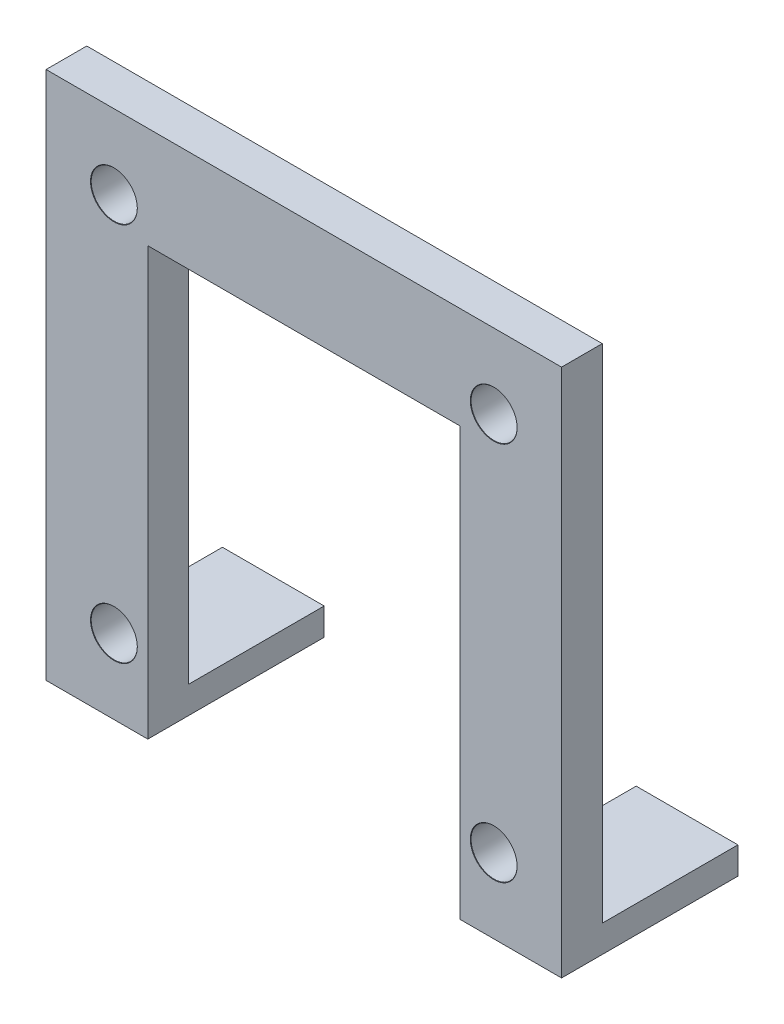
ISO-10303-21;
HEADER;
FILE_DESCRIPTION(('STEP AP214'),'2;1');
FILE_NAME('part.step','',(''),(''),'','','');
FILE_SCHEMA(('AUTOMOTIVE_DESIGN { 1 0 10303 214 1 1 1 1 }'));
ENDSEC;
DATA;
#1=APPLICATION_CONTEXT('core data for automotive mechanical design processes');
#2=APPLICATION_PROTOCOL_DEFINITION('international standard','automotive_design',2000,#1);
#3=PRODUCT_CONTEXT('',#1,'mechanical');
#4=PRODUCT('Part','Part','',(#3));
#5=PRODUCT_RELATED_PRODUCT_CATEGORY('part','',(#4));
#6=PRODUCT_DEFINITION_FORMATION('','',#4);
#7=PRODUCT_DEFINITION_CONTEXT('part definition',#1,'design');
#8=PRODUCT_DEFINITION('design','',#6,#7);
#9=PRODUCT_DEFINITION_SHAPE('','',#8);
#10=(LENGTH_UNIT() NAMED_UNIT(*) SI_UNIT(.MILLI.,.METRE.));
#11=(NAMED_UNIT(*) PLANE_ANGLE_UNIT() SI_UNIT($,.RADIAN.));
#12=(NAMED_UNIT(*) SI_UNIT($,.STERADIAN.) SOLID_ANGLE_UNIT());
#13=UNCERTAINTY_MEASURE_WITH_UNIT(LENGTH_MEASURE(1.E-05),#10,'distance_accuracy_value','');
#14=(GEOMETRIC_REPRESENTATION_CONTEXT(3) GLOBAL_UNCERTAINTY_ASSIGNED_CONTEXT((#13)) GLOBAL_UNIT_ASSIGNED_CONTEXT((#10,
#11,#12)) REPRESENTATION_CONTEXT('',''));
#15=CARTESIAN_POINT('',(0.,0.,0.));
#16=DIRECTION('',(0.,0.,1.));
#17=DIRECTION('',(1.,0.,0.));
#18=AXIS2_PLACEMENT_3D('',#15,#16,#17);
#19=CARTESIAN_POINT('',(7.5,0.,3.));
#20=DIRECTION('',(0.,1.,0.));
#21=DIRECTION('',(-1.,0.,0.));
#22=AXIS2_PLACEMENT_3D('',#19,#20,#21);
#23=PLANE('',#22);
#24=DIRECTION('',(0.,0.,-1.));
#25=VECTOR('',#24,1.);
#26=CARTESIAN_POINT('',(0.,0.,3.));
#27=LINE('',#26,#25);
#28=CARTESIAN_POINT('',(0.,0.,3.));
#29=VERTEX_POINT('',#28);
#30=CARTESIAN_POINT('',(0.,0.,-10.));
#31=VERTEX_POINT('',#30);
#32=EDGE_CURVE('E273',#29,#31,#27,.T.);
#33=ORIENTED_EDGE('',*,*,#32,.T.);
#34=DIRECTION('',(-1.,0.,0.));
#35=VECTOR('',#34,1.);
#36=CARTESIAN_POINT('',(7.5,0.,-10.));
#37=LINE('',#36,#35);
#38=CARTESIAN_POINT('',(7.5,0.,-10.));
#39=VERTEX_POINT('',#38);
#40=EDGE_CURVE('E193',#39,#31,#37,.T.);
#41=ORIENTED_EDGE('',*,*,#40,.F.);
#42=DIRECTION('',(0.,0.,-1.));
#43=VECTOR('',#42,1.);
#44=CARTESIAN_POINT('',(7.5,0.,3.));
#45=LINE('',#44,#43);
#46=CARTESIAN_POINT('',(7.5,0.,3.));
#47=VERTEX_POINT('',#46);
#48=EDGE_CURVE('E11',#47,#39,#45,.T.);
#49=ORIENTED_EDGE('',*,*,#48,.F.);
#50=DIRECTION('',(1.,0.,0.));
#51=VECTOR('',#50,1.);
#52=CARTESIAN_POINT('',(7.5,0.,3.));
#53=LINE('',#52,#51);
#54=EDGE_CURVE('E249',#29,#47,#53,.T.);
#55=ORIENTED_EDGE('',*,*,#54,.F.);
#56=EDGE_LOOP('',(#33,#41,#49,#55));
#57=FACE_BOUND('',#56,.T.);
#58=ADVANCED_FACE('F44',(#57),#23,.F.);
#59=CARTESIAN_POINT('',(7.5,31.5,3.));
#60=DIRECTION('',(-1.,0.,0.));
#61=DIRECTION('',(0.,0.,1.));
#62=AXIS2_PLACEMENT_3D('',#59,#60,#61);
#63=PLANE('',#62);
#64=ORIENTED_EDGE('',*,*,#48,.T.);
#65=DIRECTION('',(0.,-1.,0.));
#66=VECTOR('',#65,1.);
#67=CARTESIAN_POINT('',(7.5,2.00000000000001,-10.));
#68=LINE('',#67,#66);
#69=CARTESIAN_POINT('',(7.5,2.00000000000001,-10.));
#70=VERTEX_POINT('',#69);
#71=EDGE_CURVE('E186',#70,#39,#68,.T.);
#72=ORIENTED_EDGE('',*,*,#71,.F.);
#73=DIRECTION('',(0.,0.,1.));
#74=VECTOR('',#73,1.);
#75=CARTESIAN_POINT('',(7.5,2.00000000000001,-10.));
#76=LINE('',#75,#74);
#77=CARTESIAN_POINT('',(7.5,2.00000000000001,0.));
#78=VERTEX_POINT('',#77);
#79=EDGE_CURVE('E185',#70,#78,#76,.T.);
#80=ORIENTED_EDGE('',*,*,#79,.T.);
#81=DIRECTION('',(0.,1.,0.));
#82=VECTOR('',#81,1.);
#83=CARTESIAN_POINT('',(7.5,31.5,0.));
#84=LINE('',#83,#82);
#85=CARTESIAN_POINT('',(7.5,31.5,0.));
#86=VERTEX_POINT('',#85);
#87=EDGE_CURVE('E248',#78,#86,#84,.T.);
#88=ORIENTED_EDGE('',*,*,#87,.T.);
#89=DIRECTION('',(0.,0.,-1.));
#90=VECTOR('',#89,1.);
#91=CARTESIAN_POINT('',(7.5,31.5,3.));
#92=LINE('',#91,#90);
#93=CARTESIAN_POINT('',(7.5,31.5,3.));
#94=VERTEX_POINT('',#93);
#95=EDGE_CURVE('E52',#94,#86,#92,.T.);
#96=ORIENTED_EDGE('',*,*,#95,.F.);
#97=DIRECTION('',(0.,1.,0.));
#98=VECTOR('',#97,1.);
#99=CARTESIAN_POINT('',(7.5,31.5,3.));
#100=LINE('',#99,#98);
#101=EDGE_CURVE('E251',#47,#94,#100,.T.);
#102=ORIENTED_EDGE('',*,*,#101,.F.);
#103=EDGE_LOOP('',(#64,#72,#80,#88,#96,#102));
#104=FACE_BOUND('',#103,.T.);
#105=ADVANCED_FACE('F329',(#104),#63,.F.);
#106=CARTESIAN_POINT('',(30.5,31.5,3.));
#107=DIRECTION('',(0.,1.,0.));
#108=DIRECTION('',(0.,0.,1.));
#109=AXIS2_PLACEMENT_3D('',#106,#107,#108);
#110=PLANE('',#109);
#111=DIRECTION('',(1.,0.,0.));
#112=VECTOR('',#111,1.);
#113=CARTESIAN_POINT('',(30.5,31.5,0.));
#114=LINE('',#113,#112);
#115=CARTESIAN_POINT('',(30.5,31.5,0.));
#116=VERTEX_POINT('',#115);
#117=EDGE_CURVE('E279',#86,#116,#114,.T.);
#118=ORIENTED_EDGE('',*,*,#117,.T.);
#119=DIRECTION('',(0.,0.,-1.));
#120=VECTOR('',#119,1.);
#121=CARTESIAN_POINT('',(30.5,31.5,3.));
#122=LINE('',#121,#120);
#123=CARTESIAN_POINT('',(30.5,31.5,3.));
#124=VERTEX_POINT('',#123);
#125=EDGE_CURVE('E143',#124,#116,#122,.T.);
#126=ORIENTED_EDGE('',*,*,#125,.F.);
#127=DIRECTION('',(1.,0.,0.));
#128=VECTOR('',#127,1.);
#129=CARTESIAN_POINT('',(30.5,31.5,3.));
#130=LINE('',#129,#128);
#131=EDGE_CURVE('E259',#94,#124,#130,.T.);
#132=ORIENTED_EDGE('',*,*,#131,.F.);
#133=ORIENTED_EDGE('',*,*,#95,.T.);
#134=EDGE_LOOP('',(#118,#126,#132,#133));
#135=FACE_BOUND('',#134,.T.);
#136=ADVANCED_FACE('F315',(#135),#110,.F.);
#137=CARTESIAN_POINT('',(30.5,0.,3.));
#138=DIRECTION('',(1.,0.,0.));
#139=DIRECTION('',(0.,0.,-1.));
#140=AXIS2_PLACEMENT_3D('',#137,#138,#139);
#141=PLANE('',#140);
#142=DIRECTION('',(0.,-1.,0.));
#143=VECTOR('',#142,1.);
#144=CARTESIAN_POINT('',(30.5,0.,0.));
#145=LINE('',#144,#143);
#146=CARTESIAN_POINT('',(30.5,2.,0.));
#147=VERTEX_POINT('',#146);
#148=EDGE_CURVE('E281',#116,#147,#145,.T.);
#149=ORIENTED_EDGE('',*,*,#148,.T.);
#150=DIRECTION('',(0.,0.,1.));
#151=VECTOR('',#150,1.);
#152=CARTESIAN_POINT('',(30.5,2.,-10.));
#153=LINE('',#152,#151);
#154=CARTESIAN_POINT('',(30.5,2.,-10.));
#155=VERTEX_POINT('',#154);
#156=EDGE_CURVE('E155',#155,#147,#153,.T.);
#157=ORIENTED_EDGE('',*,*,#156,.F.);
#158=DIRECTION('',(0.,1.,0.));
#159=VECTOR('',#158,1.);
#160=CARTESIAN_POINT('',(30.5,0.,-10.));
#161=LINE('',#160,#159);
#162=CARTESIAN_POINT('',(30.5,0.,-10.));
#163=VERTEX_POINT('',#162);
#164=EDGE_CURVE('E146',#163,#155,#161,.T.);
#165=ORIENTED_EDGE('',*,*,#164,.F.);
#166=DIRECTION('',(0.,0.,-1.));
#167=VECTOR('',#166,1.);
#168=CARTESIAN_POINT('',(30.5,0.,3.));
#169=LINE('',#168,#167);
#170=CARTESIAN_POINT('',(30.5,0.,3.));
#171=VERTEX_POINT('',#170);
#172=EDGE_CURVE('E134',#171,#163,#169,.T.);
#173=ORIENTED_EDGE('',*,*,#172,.F.);
#174=DIRECTION('',(0.,-1.,0.));
#175=VECTOR('',#174,1.);
#176=CARTESIAN_POINT('',(30.5,0.,3.));
#177=LINE('',#176,#175);
#178=EDGE_CURVE('E261',#124,#171,#177,.T.);
#179=ORIENTED_EDGE('',*,*,#178,.F.);
#180=ORIENTED_EDGE('',*,*,#125,.T.);
#181=EDGE_LOOP('',(#149,#157,#165,#173,#179,#180));
#182=FACE_BOUND('',#181,.T.);
#183=ADVANCED_FACE('F148',(#182),#141,.F.);
#184=CARTESIAN_POINT('',(38.,0.,3.));
#185=DIRECTION('',(0.,1.,0.));
#186=DIRECTION('',(-1.,0.,0.));
#187=AXIS2_PLACEMENT_3D('',#184,#185,#186);
#188=PLANE('',#187);
#189=ORIENTED_EDGE('',*,*,#172,.T.);
#190=DIRECTION('',(-1.,0.,0.));
#191=VECTOR('',#190,1.);
#192=CARTESIAN_POINT('',(38.,0.,-10.));
#193=LINE('',#192,#191);
#194=CARTESIAN_POINT('',(38.,0.,-10.));
#195=VERTEX_POINT('',#194);
#196=EDGE_CURVE('E139',#195,#163,#193,.T.);
#197=ORIENTED_EDGE('',*,*,#196,.F.);
#198=DIRECTION('',(0.,0.,-1.));
#199=VECTOR('',#198,1.);
#200=CARTESIAN_POINT('',(38.,0.,3.));
#201=LINE('',#200,#199);
#202=CARTESIAN_POINT('',(38.,0.,3.));
#203=VERTEX_POINT('',#202);
#204=EDGE_CURVE('E147',#203,#195,#201,.T.);
#205=ORIENTED_EDGE('',*,*,#204,.F.);
#206=DIRECTION('',(1.,0.,0.));
#207=VECTOR('',#206,1.);
#208=CARTESIAN_POINT('',(38.,0.,3.));
#209=LINE('',#208,#207);
#210=EDGE_CURVE('E142',#171,#203,#209,.T.);
#211=ORIENTED_EDGE('',*,*,#210,.F.);
#212=EDGE_LOOP('',(#189,#197,#205,#211));
#213=FACE_BOUND('',#212,.T.);
#214=ADVANCED_FACE('F140',(#213),#188,.F.);
#215=CARTESIAN_POINT('',(38.,39.,3.));
#216=DIRECTION('',(-1.,0.,0.));
#217=DIRECTION('',(0.,-1.,0.));
#218=AXIS2_PLACEMENT_3D('',#215,#216,#217);
#219=PLANE('',#218);
#220=ORIENTED_EDGE('',*,*,#204,.T.);
#221=DIRECTION('',(0.,-1.,0.));
#222=VECTOR('',#221,1.);
#223=CARTESIAN_POINT('',(38.,2.,-10.));
#224=LINE('',#223,#222);
#225=CARTESIAN_POINT('',(38.,2.,-10.));
#226=VERTEX_POINT('',#225);
#227=EDGE_CURVE('E163',#226,#195,#224,.T.);
#228=ORIENTED_EDGE('',*,*,#227,.F.);
#229=DIRECTION('',(0.,0.,1.));
#230=VECTOR('',#229,1.);
#231=CARTESIAN_POINT('',(38.,2.,-10.));
#232=LINE('',#231,#230);
#233=CARTESIAN_POINT('',(38.,2.,0.));
#234=VERTEX_POINT('',#233);
#235=EDGE_CURVE('E167',#226,#234,#232,.T.);
#236=ORIENTED_EDGE('',*,*,#235,.T.);
#237=DIRECTION('',(0.,1.,0.));
#238=VECTOR('',#237,1.);
#239=CARTESIAN_POINT('',(38.,39.,0.));
#240=LINE('',#239,#238);
#241=CARTESIAN_POINT('',(38.,39.,0.));
#242=VERTEX_POINT('',#241);
#243=EDGE_CURVE('E283',#234,#242,#240,.T.);
#244=ORIENTED_EDGE('',*,*,#243,.T.);
#245=DIRECTION('',(0.,0.,-1.));
#246=VECTOR('',#245,1.);
#247=CARTESIAN_POINT('',(38.,39.,3.));
#248=LINE('',#247,#246);
#249=CARTESIAN_POINT('',(38.,39.,3.));
#250=VERTEX_POINT('',#249);
#251=EDGE_CURVE('E296',#250,#242,#248,.T.);
#252=ORIENTED_EDGE('',*,*,#251,.F.);
#253=DIRECTION('',(0.,1.,0.));
#254=VECTOR('',#253,1.);
#255=CARTESIAN_POINT('',(38.,39.,3.));
#256=LINE('',#255,#254);
#257=EDGE_CURVE('E266',#203,#250,#256,.T.);
#258=ORIENTED_EDGE('',*,*,#257,.F.);
#259=EDGE_LOOP('',(#220,#228,#236,#244,#252,#258));
#260=FACE_BOUND('',#259,.T.);
#261=ADVANCED_FACE('F322',(#260),#219,.F.);
#262=CARTESIAN_POINT('',(0.,39.,3.));
#263=DIRECTION('',(0.,-1.,0.));
#264=DIRECTION('',(0.,0.,-1.));
#265=AXIS2_PLACEMENT_3D('',#262,#263,#264);
#266=PLANE('',#265);
#267=DIRECTION('',(-1.,0.,0.));
#268=VECTOR('',#267,1.);
#269=CARTESIAN_POINT('',(0.,39.,0.));
#270=LINE('',#269,#268);
#271=CARTESIAN_POINT('',(0.,39.,0.));
#272=VERTEX_POINT('',#271);
#273=EDGE_CURVE('E290',#242,#272,#270,.T.);
#274=ORIENTED_EDGE('',*,*,#273,.T.);
#275=DIRECTION('',(0.,0.,-1.));
#276=VECTOR('',#275,1.);
#277=CARTESIAN_POINT('',(0.,39.,3.));
#278=LINE('',#277,#276);
#279=CARTESIAN_POINT('',(0.,39.,3.));
#280=VERTEX_POINT('',#279);
#281=EDGE_CURVE('E295',#280,#272,#278,.T.);
#282=ORIENTED_EDGE('',*,*,#281,.F.);
#283=DIRECTION('',(-1.,0.,0.));
#284=VECTOR('',#283,1.);
#285=CARTESIAN_POINT('',(0.,39.,3.));
#286=LINE('',#285,#284);
#287=EDGE_CURVE('E267',#250,#280,#286,.T.);
#288=ORIENTED_EDGE('',*,*,#287,.F.);
#289=ORIENTED_EDGE('',*,*,#251,.T.);
#290=EDGE_LOOP('',(#274,#282,#288,#289));
#291=FACE_BOUND('',#290,.T.);
#292=ADVANCED_FACE('F347',(#291),#266,.F.);
#293=CARTESIAN_POINT('',(0.,0.,3.));
#294=DIRECTION('',(1.,0.,0.));
#295=DIRECTION('',(0.,0.,-1.));
#296=AXIS2_PLACEMENT_3D('',#293,#294,#295);
#297=PLANE('',#296);
#298=DIRECTION('',(0.,-1.,0.));
#299=VECTOR('',#298,1.);
#300=CARTESIAN_POINT('',(0.,0.,0.));
#301=LINE('',#300,#299);
#302=CARTESIAN_POINT('',(0.,2.00000000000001,0.));
#303=VERTEX_POINT('',#302);
#304=EDGE_CURVE('E253',#272,#303,#301,.T.);
#305=ORIENTED_EDGE('',*,*,#304,.T.);
#306=DIRECTION('',(0.,0.,1.));
#307=VECTOR('',#306,1.);
#308=CARTESIAN_POINT('',(0.,2.00000000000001,-10.));
#309=LINE('',#308,#307);
#310=CARTESIAN_POINT('',(0.,2.00000000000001,-10.));
#311=VERTEX_POINT('',#310);
#312=EDGE_CURVE('E178',#311,#303,#309,.T.);
#313=ORIENTED_EDGE('',*,*,#312,.F.);
#314=DIRECTION('',(0.,1.,0.));
#315=VECTOR('',#314,1.);
#316=CARTESIAN_POINT('',(0.,0.,-10.));
#317=LINE('',#316,#315);
#318=EDGE_CURVE('E195',#31,#311,#317,.T.);
#319=ORIENTED_EDGE('',*,*,#318,.F.);
#320=ORIENTED_EDGE('',*,*,#32,.F.);
#321=DIRECTION('',(0.,-1.,0.));
#322=VECTOR('',#321,1.);
#323=CARTESIAN_POINT('',(0.,0.,3.));
#324=LINE('',#323,#322);
#325=EDGE_CURVE('E275',#280,#29,#324,.T.);
#326=ORIENTED_EDGE('',*,*,#325,.F.);
#327=ORIENTED_EDGE('',*,*,#281,.T.);
#328=EDGE_LOOP('',(#305,#313,#319,#320,#326,#327));
#329=FACE_BOUND('',#328,.T.);
#330=ADVANCED_FACE('F341',(#329),#297,.F.);
#331=CARTESIAN_POINT('',(0.,0.,3.));
#332=DIRECTION('',(0.,0.,-1.));
#333=DIRECTION('',(-1.,0.,0.));
#334=AXIS2_PLACEMENT_3D('',#331,#332,#333);
#335=PLANE('',#334);
#336=CARTESIAN_POINT('',(5.,33.5,3.));
#337=DIRECTION('',(0.,0.,1.));
#338=DIRECTION('',(1.,0.,0.));
#339=AXIS2_PLACEMENT_3D('',#336,#337,#338);
#340=CIRCLE('',#339,1.725);
#341=CARTESIAN_POINT('',(6.725,33.5,3.));
#342=VERTEX_POINT('',#341);
#343=EDGE_CURVE('E180',#342,#342,#340,.T.);
#344=ORIENTED_EDGE('',*,*,#343,.F.);
#345=EDGE_LOOP('',(#344));
#346=FACE_BOUND('',#345,.T.);
#347=CARTESIAN_POINT('',(33.,5.5,3.));
#348=DIRECTION('',(0.,0.,1.));
#349=DIRECTION('',(1.,0.,0.));
#350=AXIS2_PLACEMENT_3D('',#347,#348,#349);
#351=CIRCLE('',#350,1.725);
#352=CARTESIAN_POINT('',(34.725,5.5,3.));
#353=VERTEX_POINT('',#352);
#354=EDGE_CURVE('E214',#353,#353,#351,.T.);
#355=ORIENTED_EDGE('',*,*,#354,.F.);
#356=EDGE_LOOP('',(#355));
#357=FACE_BOUND('',#356,.T.);
#358=CARTESIAN_POINT('',(33.,33.5,3.));
#359=DIRECTION('',(0.,0.,1.));
#360=DIRECTION('',(1.,0.,0.));
#361=AXIS2_PLACEMENT_3D('',#358,#359,#360);
#362=CIRCLE('',#361,1.725);
#363=CARTESIAN_POINT('',(34.725,33.5,3.));
#364=VERTEX_POINT('',#363);
#365=EDGE_CURVE('E224',#364,#364,#362,.T.);
#366=ORIENTED_EDGE('',*,*,#365,.F.);
#367=EDGE_LOOP('',(#366));
#368=FACE_BOUND('',#367,.T.);
#369=CARTESIAN_POINT('',(5.,5.49999999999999,3.));
#370=DIRECTION('',(0.,0.,1.));
#371=DIRECTION('',(1.,0.,0.));
#372=AXIS2_PLACEMENT_3D('',#369,#370,#371);
#373=CIRCLE('',#372,1.725);
#374=CARTESIAN_POINT('',(6.725,5.49999999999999,3.));
#375=VERTEX_POINT('',#374);
#376=EDGE_CURVE('E240',#375,#375,#373,.T.);
#377=ORIENTED_EDGE('',*,*,#376,.F.);
#378=EDGE_LOOP('',(#377));
#379=FACE_BOUND('',#378,.T.);
#380=ORIENTED_EDGE('',*,*,#54,.T.);
#381=ORIENTED_EDGE('',*,*,#101,.T.);
#382=ORIENTED_EDGE('',*,*,#131,.T.);
#383=ORIENTED_EDGE('',*,*,#178,.T.);
#384=ORIENTED_EDGE('',*,*,#210,.T.);
#385=ORIENTED_EDGE('',*,*,#257,.T.);
#386=ORIENTED_EDGE('',*,*,#287,.T.);
#387=ORIENTED_EDGE('',*,*,#325,.T.);
#388=EDGE_LOOP('',(#380,#381,#382,#383,#384,#385,#386,#387));
#389=FACE_BOUND('',#388,.T.);
#390=ADVANCED_FACE('F326',(#346,#357,#368,#379,#389),#335,.F.);
#391=CARTESIAN_POINT('',(0.,0.,0.));
#392=DIRECTION('',(0.,0.,-1.));
#393=DIRECTION('',(-1.,0.,0.));
#394=AXIS2_PLACEMENT_3D('',#391,#392,#393);
#395=PLANE('',#394);
#396=DIRECTION('',(1.,0.,0.));
#397=VECTOR('',#396,1.);
#398=CARTESIAN_POINT('',(30.5,2.,0.));
#399=LINE('',#398,#397);
#400=EDGE_CURVE('E58',#147,#234,#399,.T.);
#401=ORIENTED_EDGE('',*,*,#400,.F.);
#402=ORIENTED_EDGE('',*,*,#148,.F.);
#403=ORIENTED_EDGE('',*,*,#117,.F.);
#404=ORIENTED_EDGE('',*,*,#87,.F.);
#405=DIRECTION('',(1.,0.,0.));
#406=VECTOR('',#405,1.);
#407=CARTESIAN_POINT('',(0.,2.00000000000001,0.));
#408=LINE('',#407,#406);
#409=EDGE_CURVE('E70',#303,#78,#408,.T.);
#410=ORIENTED_EDGE('',*,*,#409,.F.);
#411=ORIENTED_EDGE('',*,*,#304,.F.);
#412=ORIENTED_EDGE('',*,*,#273,.F.);
#413=ORIENTED_EDGE('',*,*,#243,.F.);
#414=EDGE_LOOP('',(#401,#402,#403,#404,#410,#411,#412,#413));
#415=FACE_BOUND('',#414,.T.);
#416=CARTESIAN_POINT('',(5.,33.5,0.));
#417=DIRECTION('',(0.,0.,1.));
#418=DIRECTION('',(1.,0.,0.));
#419=AXIS2_PLACEMENT_3D('',#416,#417,#418);
#420=CIRCLE('',#419,1.7);
#421=CARTESIAN_POINT('',(6.7,33.5,0.));
#422=VERTEX_POINT('',#421);
#423=EDGE_CURVE('E209',#422,#422,#420,.T.);
#424=ORIENTED_EDGE('',*,*,#423,.T.);
#425=EDGE_LOOP('',(#424));
#426=FACE_BOUND('',#425,.T.);
#427=CARTESIAN_POINT('',(33.,5.5,0.));
#428=DIRECTION('',(0.,0.,1.));
#429=DIRECTION('',(1.,0.,0.));
#430=AXIS2_PLACEMENT_3D('',#427,#428,#429);
#431=CIRCLE('',#430,1.7);
#432=CARTESIAN_POINT('',(34.7,5.5,0.));
#433=VERTEX_POINT('',#432);
#434=EDGE_CURVE('E221',#433,#433,#431,.T.);
#435=ORIENTED_EDGE('',*,*,#434,.T.);
#436=EDGE_LOOP('',(#435));
#437=FACE_BOUND('',#436,.T.);
#438=CARTESIAN_POINT('',(33.,33.5,0.));
#439=DIRECTION('',(0.,0.,1.));
#440=DIRECTION('',(1.,0.,0.));
#441=AXIS2_PLACEMENT_3D('',#438,#439,#440);
#442=CIRCLE('',#441,1.7);
#443=CARTESIAN_POINT('',(34.7,33.5,0.));
#444=VERTEX_POINT('',#443);
#445=EDGE_CURVE('E231',#444,#444,#442,.T.);
#446=ORIENTED_EDGE('',*,*,#445,.T.);
#447=EDGE_LOOP('',(#446));
#448=FACE_BOUND('',#447,.T.);
#449=CARTESIAN_POINT('',(5.,5.49999999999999,0.));
#450=DIRECTION('',(0.,0.,1.));
#451=DIRECTION('',(1.,0.,0.));
#452=AXIS2_PLACEMENT_3D('',#449,#450,#451);
#453=CIRCLE('',#452,1.7);
#454=CARTESIAN_POINT('',(6.7,5.49999999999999,0.));
#455=VERTEX_POINT('',#454);
#456=EDGE_CURVE('E244',#455,#455,#453,.T.);
#457=ORIENTED_EDGE('',*,*,#456,.T.);
#458=EDGE_LOOP('',(#457));
#459=FACE_BOUND('',#458,.T.);
#460=ADVANCED_FACE('F314',(#415,#426,#437,#448,#459),#395,.T.);
#461=CARTESIAN_POINT('',(5.,5.49999999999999,3.));
#462=DIRECTION('',(0.,0.,1.));
#463=DIRECTION('',(1.,0.,0.));
#464=AXIS2_PLACEMENT_3D('',#461,#462,#463);
#465=CYLINDRICAL_SURFACE('',#464,1.7);
#466=ORIENTED_EDGE('',*,*,#456,.F.);
#467=EDGE_LOOP('',(#466));
#468=FACE_BOUND('',#467,.T.);
#469=CARTESIAN_POINT('',(5.,5.49999999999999,2.975));
#470=DIRECTION('',(0.,0.,1.));
#471=DIRECTION('',(1.,0.,0.));
#472=AXIS2_PLACEMENT_3D('',#469,#470,#471);
#473=CIRCLE('',#472,1.7);
#474=CARTESIAN_POINT('',(6.7,5.49999999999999,2.975));
#475=VERTEX_POINT('',#474);
#476=EDGE_CURVE('E241',#475,#475,#473,.T.);
#477=ORIENTED_EDGE('',*,*,#476,.T.);
#478=EDGE_LOOP('',(#477));
#479=FACE_BOUND('',#478,.T.);
#480=ADVANCED_FACE('F392',(#468,#479),#465,.F.);
#481=CARTESIAN_POINT('',(5.,5.49999999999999,3.));
#482=DIRECTION('',(0.,0.,1.));
#483=DIRECTION('',(1.,0.,0.));
#484=AXIS2_PLACEMENT_3D('',#481,#482,#483);
#485=CONICAL_SURFACE('',#484,1.725,0.785398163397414);
#486=ORIENTED_EDGE('',*,*,#476,.F.);
#487=EDGE_LOOP('',(#486));
#488=FACE_BOUND('',#487,.T.);
#489=ORIENTED_EDGE('',*,*,#376,.T.);
#490=EDGE_LOOP('',(#489));
#491=FACE_BOUND('',#490,.T.);
#492=ADVANCED_FACE('F478',(#488,#491),#485,.F.);
#493=CARTESIAN_POINT('',(33.,33.5,3.));
#494=DIRECTION('',(0.,0.,1.));
#495=DIRECTION('',(1.,0.,0.));
#496=AXIS2_PLACEMENT_3D('',#493,#494,#495);
#497=CYLINDRICAL_SURFACE('',#496,1.7);
#498=ORIENTED_EDGE('',*,*,#445,.F.);
#499=EDGE_LOOP('',(#498));
#500=FACE_BOUND('',#499,.T.);
#501=CARTESIAN_POINT('',(33.,33.5,2.975));
#502=DIRECTION('',(0.,0.,1.));
#503=DIRECTION('',(1.,0.,0.));
#504=AXIS2_PLACEMENT_3D('',#501,#502,#503);
#505=CIRCLE('',#504,1.7);
#506=CARTESIAN_POINT('',(34.7,33.5,2.975));
#507=VERTEX_POINT('',#506);
#508=EDGE_CURVE('E230',#507,#507,#505,.T.);
#509=ORIENTED_EDGE('',*,*,#508,.T.);
#510=EDGE_LOOP('',(#509));
#511=FACE_BOUND('',#510,.T.);
#512=ADVANCED_FACE('F468',(#500,#511),#497,.F.);
#513=CARTESIAN_POINT('',(33.,33.5,3.));
#514=DIRECTION('',(0.,0.,1.));
#515=DIRECTION('',(1.,0.,0.));
#516=AXIS2_PLACEMENT_3D('',#513,#514,#515);
#517=CONICAL_SURFACE('',#516,1.725,0.785398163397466);
#518=ORIENTED_EDGE('',*,*,#508,.F.);
#519=EDGE_LOOP('',(#518));
#520=FACE_BOUND('',#519,.T.);
#521=ORIENTED_EDGE('',*,*,#365,.T.);
#522=EDGE_LOOP('',(#521));
#523=FACE_BOUND('',#522,.T.);
#524=ADVANCED_FACE('F461',(#520,#523),#517,.F.);
#525=CARTESIAN_POINT('',(33.,5.5,3.));
#526=DIRECTION('',(0.,0.,1.));
#527=DIRECTION('',(1.,0.,0.));
#528=AXIS2_PLACEMENT_3D('',#525,#526,#527);
#529=CYLINDRICAL_SURFACE('',#528,1.7);
#530=ORIENTED_EDGE('',*,*,#434,.F.);
#531=EDGE_LOOP('',(#530));
#532=FACE_BOUND('',#531,.T.);
#533=CARTESIAN_POINT('',(33.,5.5,2.975));
#534=DIRECTION('',(0.,0.,1.));
#535=DIRECTION('',(1.,0.,0.));
#536=AXIS2_PLACEMENT_3D('',#533,#534,#535);
#537=CIRCLE('',#536,1.7);
#538=CARTESIAN_POINT('',(34.7,5.5,2.975));
#539=VERTEX_POINT('',#538);
#540=EDGE_CURVE('E220',#539,#539,#537,.T.);
#541=ORIENTED_EDGE('',*,*,#540,.T.);
#542=EDGE_LOOP('',(#541));
#543=FACE_BOUND('',#542,.T.);
#544=ADVANCED_FACE('F455',(#532,#543),#529,.F.);
#545=CARTESIAN_POINT('',(33.,5.5,3.));
#546=DIRECTION('',(0.,0.,1.));
#547=DIRECTION('',(1.,0.,0.));
#548=AXIS2_PLACEMENT_3D('',#545,#546,#547);
#549=CONICAL_SURFACE('',#548,1.725,0.785398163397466);
#550=ORIENTED_EDGE('',*,*,#540,.F.);
#551=EDGE_LOOP('',(#550));
#552=FACE_BOUND('',#551,.T.);
#553=ORIENTED_EDGE('',*,*,#354,.T.);
#554=EDGE_LOOP('',(#553));
#555=FACE_BOUND('',#554,.T.);
#556=ADVANCED_FACE('F442',(#552,#555),#549,.F.);
#557=CARTESIAN_POINT('',(5.,33.5,3.));
#558=DIRECTION('',(0.,0.,1.));
#559=DIRECTION('',(1.,0.,0.));
#560=AXIS2_PLACEMENT_3D('',#557,#558,#559);
#561=CYLINDRICAL_SURFACE('',#560,1.7);
#562=ORIENTED_EDGE('',*,*,#423,.F.);
#563=EDGE_LOOP('',(#562));
#564=FACE_BOUND('',#563,.T.);
#565=CARTESIAN_POINT('',(5.,33.5,2.975));
#566=DIRECTION('',(0.,0.,1.));
#567=DIRECTION('',(1.,0.,0.));
#568=AXIS2_PLACEMENT_3D('',#565,#566,#567);
#569=CIRCLE('',#568,1.7);
#570=CARTESIAN_POINT('',(6.7,33.5,2.975));
#571=VERTEX_POINT('',#570);
#572=EDGE_CURVE('E204',#571,#571,#569,.T.);
#573=ORIENTED_EDGE('',*,*,#572,.T.);
#574=EDGE_LOOP('',(#573));
#575=FACE_BOUND('',#574,.T.);
#576=ADVANCED_FACE('F432',(#564,#575),#561,.F.);
#577=CARTESIAN_POINT('',(5.,33.5,3.));
#578=DIRECTION('',(0.,0.,1.));
#579=DIRECTION('',(1.,0.,0.));
#580=AXIS2_PLACEMENT_3D('',#577,#578,#579);
#581=CONICAL_SURFACE('',#580,1.725,0.785398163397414);
#582=ORIENTED_EDGE('',*,*,#572,.F.);
#583=EDGE_LOOP('',(#582));
#584=FACE_BOUND('',#583,.T.);
#585=ORIENTED_EDGE('',*,*,#343,.T.);
#586=EDGE_LOOP('',(#585));
#587=FACE_BOUND('',#586,.T.);
#588=ADVANCED_FACE('F402',(#584,#587),#581,.F.);
#589=CARTESIAN_POINT('',(0.,2.00000000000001,-10.));
#590=DIRECTION('',(0.,-1.,0.));
#591=DIRECTION('',(1.,0.,0.));
#592=AXIS2_PLACEMENT_3D('',#589,#590,#591);
#593=PLANE('',#592);
#594=ORIENTED_EDGE('',*,*,#409,.T.);
#595=ORIENTED_EDGE('',*,*,#79,.F.);
#596=DIRECTION('',(1.,0.,0.));
#597=VECTOR('',#596,1.);
#598=CARTESIAN_POINT('',(0.,2.00000000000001,-10.));
#599=LINE('',#598,#597);
#600=EDGE_CURVE('E187',#311,#70,#599,.T.);
#601=ORIENTED_EDGE('',*,*,#600,.F.);
#602=ORIENTED_EDGE('',*,*,#312,.T.);
#603=EDGE_LOOP('',(#594,#595,#601,#602));
#604=FACE_BOUND('',#603,.T.);
#605=ADVANCED_FACE('F345',(#604),#593,.F.);
#606=CARTESIAN_POINT('',(0.,0.,-10.));
#607=DIRECTION('',(0.,0.,-1.));
#608=DIRECTION('',(-1.,0.,0.));
#609=AXIS2_PLACEMENT_3D('',#606,#607,#608);
#610=PLANE('',#609);
#611=ORIENTED_EDGE('',*,*,#71,.T.);
#612=ORIENTED_EDGE('',*,*,#40,.T.);
#613=ORIENTED_EDGE('',*,*,#318,.T.);
#614=ORIENTED_EDGE('',*,*,#600,.T.);
#615=EDGE_LOOP('',(#611,#612,#613,#614));
#616=FACE_BOUND('',#615,.T.);
#617=ADVANCED_FACE('F340',(#616),#610,.T.);
#618=CARTESIAN_POINT('',(30.5,2.,-10.));
#619=DIRECTION('',(0.,-1.,0.));
#620=DIRECTION('',(1.,0.,0.));
#621=AXIS2_PLACEMENT_3D('',#618,#619,#620);
#622=PLANE('',#621);
#623=ORIENTED_EDGE('',*,*,#400,.T.);
#624=ORIENTED_EDGE('',*,*,#235,.F.);
#625=DIRECTION('',(1.,0.,0.));
#626=VECTOR('',#625,1.);
#627=CARTESIAN_POINT('',(30.5,2.,-10.));
#628=LINE('',#627,#626);
#629=EDGE_CURVE('E156',#155,#226,#628,.T.);
#630=ORIENTED_EDGE('',*,*,#629,.F.);
#631=ORIENTED_EDGE('',*,*,#156,.T.);
#632=EDGE_LOOP('',(#623,#624,#630,#631));
#633=FACE_BOUND('',#632,.T.);
#634=ADVANCED_FACE('F319',(#633),#622,.F.);
#635=CARTESIAN_POINT('',(0.,0.,-10.));
#636=DIRECTION('',(0.,0.,-1.));
#637=DIRECTION('',(-1.,0.,0.));
#638=AXIS2_PLACEMENT_3D('',#635,#636,#637);
#639=PLANE('',#638);
#640=ORIENTED_EDGE('',*,*,#196,.T.);
#641=ORIENTED_EDGE('',*,*,#164,.T.);
#642=ORIENTED_EDGE('',*,*,#629,.T.);
#643=ORIENTED_EDGE('',*,*,#227,.T.);
#644=EDGE_LOOP('',(#640,#641,#642,#643));
#645=FACE_BOUND('',#644,.T.);
#646=ADVANCED_FACE('F157',(#645),#639,.T.);
#647=CLOSED_SHELL('',(#58,#105,#136,#183,#214,#261,#292,#330,#390,#460,#480,#492,#512,#524,#544,
#556,#576,#588,#605,#617,#634,#646));
#648=MANIFOLD_SOLID_BREP('B2',#647);
#649=ADVANCED_BREP_SHAPE_REPRESENTATION('',(#18,#648),#14);
#650=SHAPE_DEFINITION_REPRESENTATION(#9,#649);
ENDSEC;
END-ISO-10303-21;
